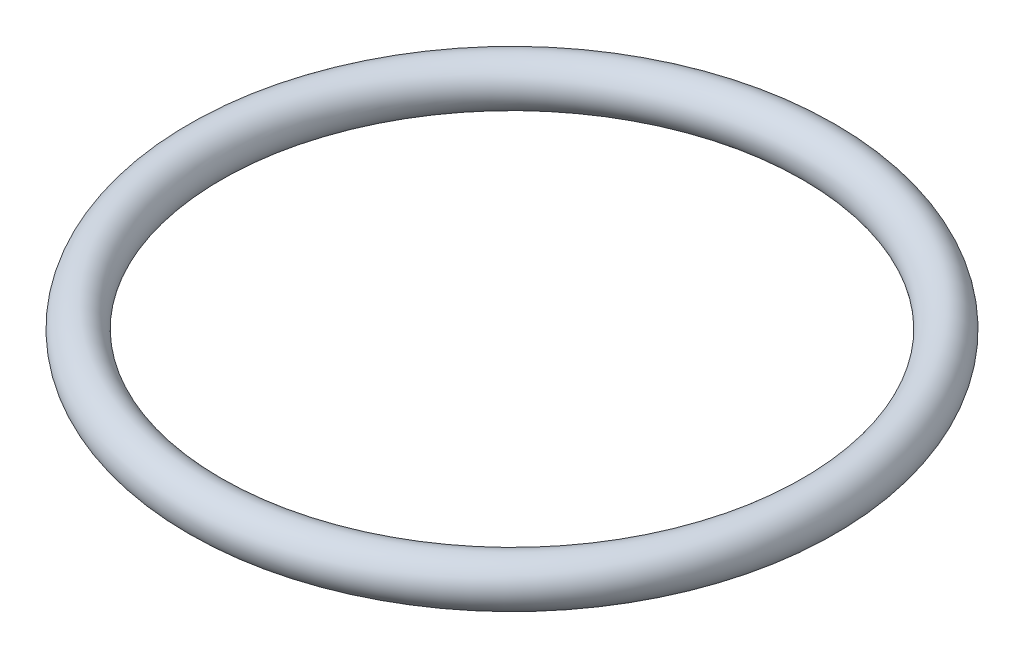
from build123d import *

# Parameters (mm, degrees)
SKETCH2_R = 0.889


with BuildPart() as part:
    # Sweep1: sweep along a path in Sketch1
    with BuildLine(Plane(origin=(0, 0, 0), x_dir=(1, 0, 0), z_dir=(0, 1, 0))) as sweep1_path:
        CenterArc((0, 0), 11.1125, 0, 360)
    # Sketch2 → Sweep1 (sweep)
    with BuildSketch(Plane.XY):
        with Locations((-12.0015, 0)):
            Circle(SKETCH2_R)
    sweep(path=sweep1_path.line)


solid = part.part
